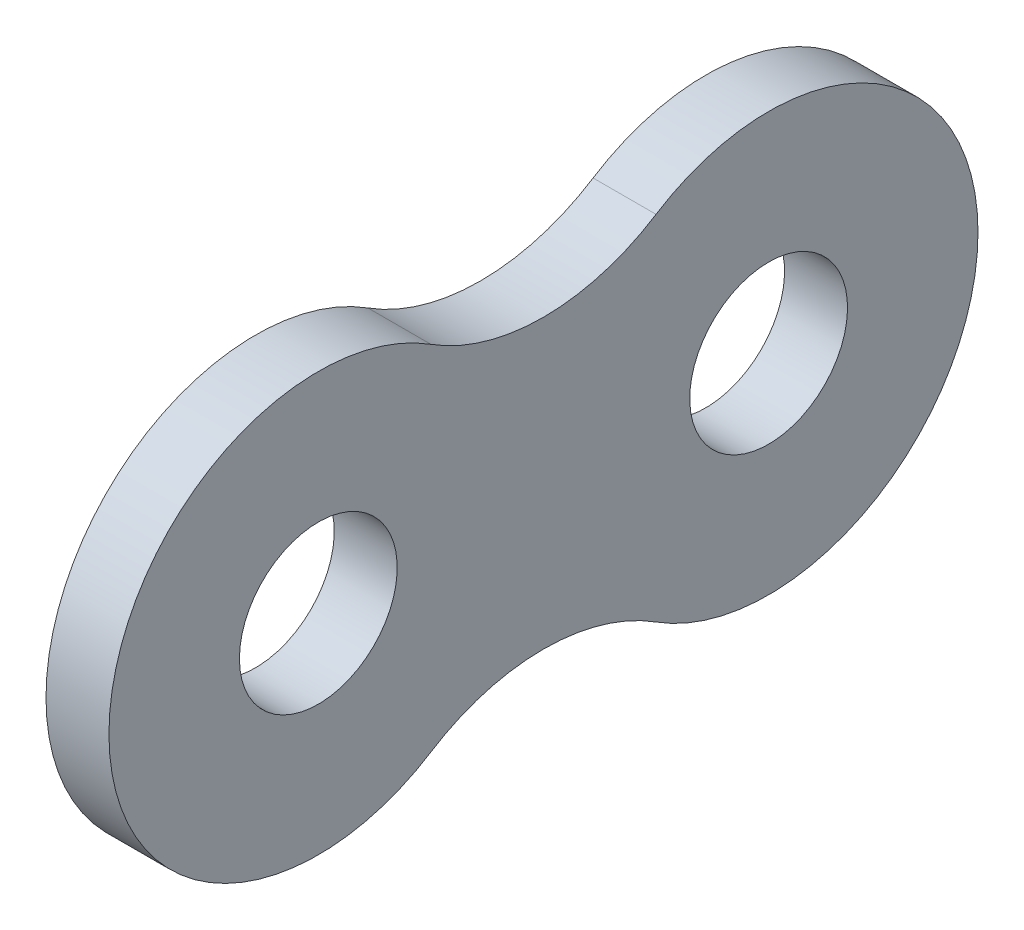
ISO-10303-21;
HEADER;
FILE_DESCRIPTION(('STEP AP214'),'2;1');
FILE_NAME('part.step','',(''),(''),'','','');
FILE_SCHEMA(('AUTOMOTIVE_DESIGN { 1 0 10303 214 1 1 1 1 }'));
ENDSEC;
DATA;
#1=APPLICATION_CONTEXT('core data for automotive mechanical design processes');
#2=APPLICATION_PROTOCOL_DEFINITION('international standard','automotive_design',2000,#1);
#3=PRODUCT_CONTEXT('',#1,'mechanical');
#4=PRODUCT('Part','Part','',(#3));
#5=PRODUCT_RELATED_PRODUCT_CATEGORY('part','',(#4));
#6=PRODUCT_DEFINITION_FORMATION('','',#4);
#7=PRODUCT_DEFINITION_CONTEXT('part definition',#1,'design');
#8=PRODUCT_DEFINITION('design','',#6,#7);
#9=PRODUCT_DEFINITION_SHAPE('','',#8);
#10=(LENGTH_UNIT() NAMED_UNIT(*) SI_UNIT(.MILLI.,.METRE.));
#11=(NAMED_UNIT(*) PLANE_ANGLE_UNIT() SI_UNIT($,.RADIAN.));
#12=(NAMED_UNIT(*) SI_UNIT($,.STERADIAN.) SOLID_ANGLE_UNIT());
#13=UNCERTAINTY_MEASURE_WITH_UNIT(LENGTH_MEASURE(1.E-05),#10,'distance_accuracy_value','');
#14=(GEOMETRIC_REPRESENTATION_CONTEXT(3) GLOBAL_UNCERTAINTY_ASSIGNED_CONTEXT((#13)) GLOBAL_UNIT_ASSIGNED_CONTEXT((#10,
#11,#12)) REPRESENTATION_CONTEXT('',''));
#15=CARTESIAN_POINT('',(0.,0.,0.));
#16=DIRECTION('',(0.,0.,1.));
#17=DIRECTION('',(1.,0.,0.));
#18=AXIS2_PLACEMENT_3D('',#15,#16,#17);
#19=CARTESIAN_POINT('',(228.99595296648,-103.885728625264,46.6500000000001));
#20=DIRECTION('',(1.,0.,0.));
#21=DIRECTION('',(0.,1.,0.));
#22=AXIS2_PLACEMENT_3D('',#19,#20,#21);
#23=CYLINDRICAL_SURFACE('',#22,2.22499999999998);
#24=CARTESIAN_POINT('',(228.10845296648,-103.885728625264,46.6500000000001));
#25=DIRECTION('',(-1.,0.,0.));
#26=DIRECTION('',(0.,0.,1.));
#27=AXIS2_PLACEMENT_3D('',#24,#25,#26);
#28=CIRCLE('',#27,2.225);
#29=CARTESIAN_POINT('',(228.10845296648,-103.885728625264,48.875));
#30=VERTEX_POINT('',#29);
#31=EDGE_CURVE('E10',#30,#30,#28,.T.);
#32=ORIENTED_EDGE('',*,*,#31,.T.);
#33=EDGE_LOOP('',(#32));
#34=FACE_BOUND('',#33,.T.);
#35=CARTESIAN_POINT('',(229.883452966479,-103.885728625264,46.6500000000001));
#36=DIRECTION('',(1.,0.,0.));
#37=DIRECTION('',(0.,1.,0.));
#38=AXIS2_PLACEMENT_3D('',#35,#36,#37);
#39=CIRCLE('',#38,2.225);
#40=CARTESIAN_POINT('',(229.883452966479,-101.660728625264,46.6500000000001));
#41=VERTEX_POINT('',#40);
#42=EDGE_CURVE('E26',#41,#41,#39,.T.);
#43=ORIENTED_EDGE('',*,*,#42,.T.);
#44=EDGE_LOOP('',(#43));
#45=FACE_BOUND('',#44,.T.);
#46=ADVANCED_FACE('F16',(#34,#45),#23,.F.);
#47=CARTESIAN_POINT('',(236.004694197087,-103.885728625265,59.35));
#48=DIRECTION('',(-1.,0.,0.));
#49=DIRECTION('',(0.,0.,1.));
#50=AXIS2_PLACEMENT_3D('',#47,#48,#49);
#51=CYLINDRICAL_SURFACE('',#50,2.22500000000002);
#52=CARTESIAN_POINT('',(228.10845296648,-103.885728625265,59.35));
#53=DIRECTION('',(1.,0.,0.));
#54=DIRECTION('',(0.,1.,0.));
#55=AXIS2_PLACEMENT_3D('',#52,#53,#54);
#56=CIRCLE('',#55,2.225);
#57=CARTESIAN_POINT('',(228.10845296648,-101.660728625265,59.35));
#58=VERTEX_POINT('',#57);
#59=EDGE_CURVE('E70',#58,#58,#56,.T.);
#60=ORIENTED_EDGE('',*,*,#59,.F.);
#61=EDGE_LOOP('',(#60));
#62=FACE_BOUND('',#61,.T.);
#63=CARTESIAN_POINT('',(229.883452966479,-103.885728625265,59.35));
#64=DIRECTION('',(-1.,0.,0.));
#65=DIRECTION('',(0.,0.,1.));
#66=AXIS2_PLACEMENT_3D('',#63,#64,#65);
#67=CIRCLE('',#66,2.22500000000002);
#68=CARTESIAN_POINT('',(229.883452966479,-103.885728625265,61.575));
#69=VERTEX_POINT('',#68);
#70=EDGE_CURVE('E92',#69,#69,#67,.T.);
#71=ORIENTED_EDGE('',*,*,#70,.F.);
#72=EDGE_LOOP('',(#71));
#73=FACE_BOUND('',#72,.T.);
#74=ADVANCED_FACE('F108',(#62,#73),#51,.F.);
#75=CARTESIAN_POINT('',(229.883452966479,-97.9807286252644,53.));
#76=DIRECTION('',(-1.,0.,0.));
#77=DIRECTION('',(0.,0.,1.));
#78=AXIS2_PLACEMENT_3D('',#75,#76,#77);
#79=PLANE('',#78);
#80=CARTESIAN_POINT('',(229.883452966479,-113.843318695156,53.));
#81=DIRECTION('',(1.,0.,0.));
#82=DIRECTION('',(0.,1.,0.));
#83=AXIS2_PLACEMENT_3D('',#80,#81,#82);
#84=CIRCLE('',#83,5.905);
#85=CARTESIAN_POINT('',(229.883452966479,-108.86452366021,49.825));
#86=VERTEX_POINT('',#85);
#87=CARTESIAN_POINT('',(229.883452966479,-108.86452366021,56.175));
#88=VERTEX_POINT('',#87);
#89=EDGE_CURVE('E77',#86,#88,#84,.T.);
#90=ORIENTED_EDGE('',*,*,#89,.F.);
#91=CARTESIAN_POINT('',(229.883452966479,-103.885728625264,46.6500000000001));
#92=DIRECTION('',(-1.,0.,0.));
#93=DIRECTION('',(0.,0.,1.));
#94=AXIS2_PLACEMENT_3D('',#91,#92,#93);
#95=CIRCLE('',#94,5.905);
#96=CARTESIAN_POINT('',(229.883452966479,-98.9069335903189,49.825));
#97=VERTEX_POINT('',#96);
#98=EDGE_CURVE('E35',#97,#86,#95,.T.);
#99=ORIENTED_EDGE('',*,*,#98,.F.);
#100=CARTESIAN_POINT('',(229.883452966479,-93.9281385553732,53.0000000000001));
#101=DIRECTION('',(1.,0.,0.));
#102=DIRECTION('',(0.,1.,0.));
#103=AXIS2_PLACEMENT_3D('',#100,#101,#102);
#104=CIRCLE('',#103,5.905);
#105=CARTESIAN_POINT('',(229.883452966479,-98.9069335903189,56.175));
#106=VERTEX_POINT('',#105);
#107=EDGE_CURVE('E86',#106,#97,#104,.T.);
#108=ORIENTED_EDGE('',*,*,#107,.F.);
#109=CARTESIAN_POINT('',(229.883452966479,-103.885728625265,59.35));
#110=DIRECTION('',(1.,0.,0.));
#111=DIRECTION('',(0.,1.,0.));
#112=AXIS2_PLACEMENT_3D('',#109,#110,#111);
#113=CIRCLE('',#112,5.905);
#114=EDGE_CURVE('E90',#106,#88,#113,.T.);
#115=ORIENTED_EDGE('',*,*,#114,.T.);
#116=EDGE_LOOP('',(#90,#99,#108,#115));
#117=FACE_BOUND('',#116,.T.);
#118=ORIENTED_EDGE('',*,*,#70,.T.);
#119=EDGE_LOOP('',(#118));
#120=FACE_BOUND('',#119,.T.);
#121=ORIENTED_EDGE('',*,*,#42,.F.);
#122=EDGE_LOOP('',(#121));
#123=FACE_BOUND('',#122,.T.);
#124=ADVANCED_FACE('F106',(#117,#120,#123),#79,.F.);
#125=CARTESIAN_POINT('',(228.10845296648,-97.9807286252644,53.));
#126=DIRECTION('',(-1.,0.,0.));
#127=DIRECTION('',(0.,0.,1.));
#128=AXIS2_PLACEMENT_3D('',#125,#126,#127);
#129=PLANE('',#128);
#130=CARTESIAN_POINT('',(228.10845296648,-93.9281385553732,53.0000000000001));
#131=DIRECTION('',(1.,0.,0.));
#132=DIRECTION('',(0.,1.,0.));
#133=AXIS2_PLACEMENT_3D('',#130,#131,#132);
#134=CIRCLE('',#133,5.905);
#135=CARTESIAN_POINT('',(228.10845296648,-98.9069335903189,56.175));
#136=VERTEX_POINT('',#135);
#137=CARTESIAN_POINT('',(228.10845296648,-98.9069335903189,49.825));
#138=VERTEX_POINT('',#137);
#139=EDGE_CURVE('E93',#136,#138,#134,.T.);
#140=ORIENTED_EDGE('',*,*,#139,.T.);
#141=CARTESIAN_POINT('',(228.10845296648,-103.885728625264,46.6500000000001));
#142=DIRECTION('',(-1.,0.,0.));
#143=DIRECTION('',(0.,0.,1.));
#144=AXIS2_PLACEMENT_3D('',#141,#142,#143);
#145=CIRCLE('',#144,5.905);
#146=CARTESIAN_POINT('',(228.10845296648,-108.86452366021,49.825));
#147=VERTEX_POINT('',#146);
#148=EDGE_CURVE('E74',#138,#147,#145,.T.);
#149=ORIENTED_EDGE('',*,*,#148,.T.);
#150=CARTESIAN_POINT('',(228.10845296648,-113.843318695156,53.));
#151=DIRECTION('',(1.,0.,0.));
#152=DIRECTION('',(0.,1.,0.));
#153=AXIS2_PLACEMENT_3D('',#150,#151,#152);
#154=CIRCLE('',#153,5.905);
#155=CARTESIAN_POINT('',(228.10845296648,-108.86452366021,56.175));
#156=VERTEX_POINT('',#155);
#157=EDGE_CURVE('E57',#147,#156,#154,.T.);
#158=ORIENTED_EDGE('',*,*,#157,.T.);
#159=CARTESIAN_POINT('',(228.10845296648,-103.885728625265,59.35));
#160=DIRECTION('',(-1.,0.,0.));
#161=DIRECTION('',(0.,0.,1.));
#162=AXIS2_PLACEMENT_3D('',#159,#160,#161);
#163=CIRCLE('',#162,5.905);
#164=EDGE_CURVE('E63',#156,#136,#163,.T.);
#165=ORIENTED_EDGE('',*,*,#164,.T.);
#166=EDGE_LOOP('',(#140,#149,#158,#165));
#167=FACE_BOUND('',#166,.T.);
#168=ORIENTED_EDGE('',*,*,#31,.F.);
#169=EDGE_LOOP('',(#168));
#170=FACE_BOUND('',#169,.T.);
#171=ORIENTED_EDGE('',*,*,#59,.T.);
#172=EDGE_LOOP('',(#171));
#173=FACE_BOUND('',#172,.T.);
#174=ADVANCED_FACE('F72',(#167,#170,#173),#129,.T.);
#175=CARTESIAN_POINT('',(228.99595296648,-113.843318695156,53.));
#176=DIRECTION('',(1.,0.,0.));
#177=DIRECTION('',(0.,1.,0.));
#178=AXIS2_PLACEMENT_3D('',#175,#176,#177);
#179=CYLINDRICAL_SURFACE('',#178,5.90500000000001);
#180=ORIENTED_EDGE('',*,*,#157,.F.);
#181=DIRECTION('',(-1.,0.,0.));
#182=VECTOR('',#181,1.);
#183=CARTESIAN_POINT('',(229.883452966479,-108.86452366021,49.825));
#184=LINE('',#183,#182);
#185=EDGE_CURVE('E81',#86,#147,#184,.T.);
#186=ORIENTED_EDGE('',*,*,#185,.F.);
#187=ORIENTED_EDGE('',*,*,#89,.T.);
#188=DIRECTION('',(-1.,0.,0.));
#189=VECTOR('',#188,1.);
#190=CARTESIAN_POINT('',(229.883452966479,-108.86452366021,56.175));
#191=LINE('',#190,#189);
#192=EDGE_CURVE('E65',#88,#156,#191,.T.);
#193=ORIENTED_EDGE('',*,*,#192,.T.);
#194=EDGE_LOOP('',(#180,#186,#187,#193));
#195=FACE_BOUND('',#194,.T.);
#196=ADVANCED_FACE('F76',(#195),#179,.F.);
#197=CARTESIAN_POINT('',(228.99595296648,-103.885728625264,46.6500000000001));
#198=DIRECTION('',(1.,0.,0.));
#199=DIRECTION('',(0.,1.,0.));
#200=AXIS2_PLACEMENT_3D('',#197,#198,#199);
#201=CYLINDRICAL_SURFACE('',#200,5.905);
#202=ORIENTED_EDGE('',*,*,#148,.F.);
#203=DIRECTION('',(-1.,0.,0.));
#204=VECTOR('',#203,1.);
#205=CARTESIAN_POINT('',(229.883452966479,-98.9069335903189,49.825));
#206=LINE('',#205,#204);
#207=EDGE_CURVE('E84',#97,#138,#206,.T.);
#208=ORIENTED_EDGE('',*,*,#207,.F.);
#209=ORIENTED_EDGE('',*,*,#98,.T.);
#210=ORIENTED_EDGE('',*,*,#185,.T.);
#211=EDGE_LOOP('',(#202,#208,#209,#210));
#212=FACE_BOUND('',#211,.T.);
#213=ADVANCED_FACE('F128',(#212),#201,.T.);
#214=CARTESIAN_POINT('',(228.99595296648,-93.9281385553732,53.0000000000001));
#215=DIRECTION('',(1.,0.,0.));
#216=DIRECTION('',(0.,1.,0.));
#217=AXIS2_PLACEMENT_3D('',#214,#215,#216);
#218=CYLINDRICAL_SURFACE('',#217,5.90499999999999);
#219=ORIENTED_EDGE('',*,*,#139,.F.);
#220=DIRECTION('',(-1.,0.,0.));
#221=VECTOR('',#220,1.);
#222=CARTESIAN_POINT('',(229.883452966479,-98.9069335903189,56.175));
#223=LINE('',#222,#221);
#224=EDGE_CURVE('E20',#106,#136,#223,.T.);
#225=ORIENTED_EDGE('',*,*,#224,.F.);
#226=ORIENTED_EDGE('',*,*,#107,.T.);
#227=ORIENTED_EDGE('',*,*,#207,.T.);
#228=EDGE_LOOP('',(#219,#225,#226,#227));
#229=FACE_BOUND('',#228,.T.);
#230=ADVANCED_FACE('F125',(#229),#218,.F.);
#231=CARTESIAN_POINT('',(228.99595296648,-103.885728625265,59.35));
#232=DIRECTION('',(1.,0.,0.));
#233=DIRECTION('',(0.,1.,0.));
#234=AXIS2_PLACEMENT_3D('',#231,#232,#233);
#235=CYLINDRICAL_SURFACE('',#234,5.90500000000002);
#236=ORIENTED_EDGE('',*,*,#114,.F.);
#237=ORIENTED_EDGE('',*,*,#224,.T.);
#238=ORIENTED_EDGE('',*,*,#164,.F.);
#239=ORIENTED_EDGE('',*,*,#192,.F.);
#240=EDGE_LOOP('',(#236,#237,#238,#239));
#241=FACE_BOUND('',#240,.T.);
#242=ADVANCED_FACE('F18',(#241),#235,.T.);
#243=CLOSED_SHELL('',(#46,#74,#124,#174,#196,#213,#230,#242));
#244=MANIFOLD_SOLID_BREP('B1',#243);
#245=ADVANCED_BREP_SHAPE_REPRESENTATION('',(#18,#244),#14);
#246=SHAPE_DEFINITION_REPRESENTATION(#9,#245);
ENDSEC;
END-ISO-10303-21;
